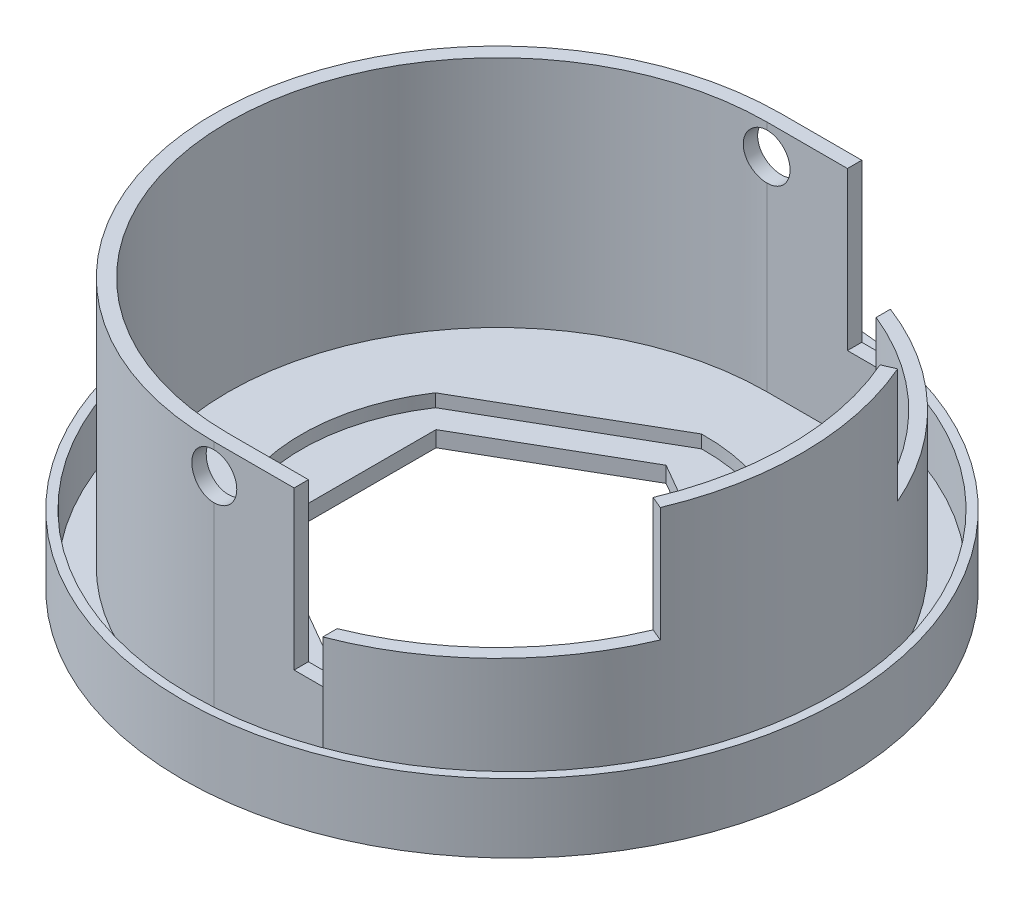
from build123d import *

# Parameters (mm, degrees)
SKETCH_2_W           = 50
SKETCH_2_H           = 50
EXTRUDE_2_DEPTH      = 2
SKETCH_6_W           = 68.418235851
SKETCH_6_H           = 62.547603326
CUT_EXTRUDE_4_DEPTH  = 2
CUT_EXTRUDE_5_DEPTH  = 2
CUT_EXTRUDE_6_DEPTH  = 0.9
EXTRUDE_3_DEPTH      = 2
EXTRUDE_4_DEPTH      = 16.3
EXTRUDE_4_DEPTH_BACK = 2
SKETCH_12_W          = 2
SKETCH_12_H          = 39.6
CUT_EXTRUDE_8_DEPTH  = 11
SKETCH_13_R          = 23
SKETCH_13_R_2        = 19.234840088
EXTRUDE_5_DEPTH      = 0.8
SKETCH_14_R          = 23
SKETCH_14_R_2        = 22.4
EXTRUDE_6_DEPTH      = 4
SKETCH_15_R          = 1.6
CUT_EXTRUDE_9_DEPTH  = 1.2
CUT_EXTRUDE_START    = -1.2
SKETCH_16_R          = 1.6
CUT_EXTRUDE_10_DEPTH = 1.2
SKETCH_17_R          = 15
SKETCH_17_R_2        = 14
CUT_EXTRUDE_11_DEPTH = 0.6
SKETCH_18_R          = 1.5
CUT_EXTRUDE_12_DEPTH = 0.7
CUT_EXTRUDE_13_DEPTH = 8
SKETCH_20_R          = 17
SKETCH_20_R_2        = 16.5
EXTRUDE_7_DEPTH      = 3


with BuildPart() as part:
    # Sketch 2 → Extrude 2 (new body)
    with BuildSketch(Plane(origin=(0, 0, 0), x_dir=(1, 0, 0), z_dir=(0, 1, 0))):
        Rectangle(SKETCH_2_W, SKETCH_2_H)
    extrude(amount=EXTRUDE_2_DEPTH)

    # Sketch 6 → Cut-Extrude 4 (cut)
    with BuildSketch(Plane(origin=(19.566219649, 2, 0), x_dir=(1, 0, 0), z_dir=(0, 1, 0))):
        with Locations((-16.859445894, -2.398316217)):
            Rectangle(SKETCH_6_W, SKETCH_6_H)
        with BuildLine():
            Line((-19.566219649, -18.5), (-11.966877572, -18.5))
            ThreePointArc((-11.966877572, -18.5), (0.433780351, 0), (-11.966877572, 18.5))
            Line((-11.966877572, 18.5), (-19.566219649, 18.5))
            ThreePointArc((-19.566219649, 18.5), (-38.066219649, 0), (-19.566219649, -18.5))
        make_face(mode=Mode.SUBTRACT)
    extrude(amount=-CUT_EXTRUDE_4_DEPTH, mode=Mode.SUBTRACT)

    # Sketch 7 → Cut-Extrude 5 (cut)
    with BuildSketch(Plane(origin=(19.566219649, 0, 0), x_dir=(-1, 0, 0), z_dir=(0, -1, 0))):
        Polygon((19.566219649, 11.749077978), (9.391219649, 5.874538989), (9.391219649, -5.874538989), (19.566219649, -11.749077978), (29.741219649, -5.874538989), (29.741219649, 5.874538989), align=None)
    extrude(amount=-CUT_EXTRUDE_5_DEPTH, mode=Mode.SUBTRACT)

    # Sketch 8 → Cut-Extrude 6 (cut)
    with BuildSketch(Plane(origin=(0, 2, 0), x_dir=(1, 0, 0), z_dir=(0, 1, 0))):
        with BuildLine():
            Line((12.375, 6.8), (12.375, -6.8))
            ThreePointArc((12.375, -6.8), (7.323143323, -12.092998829), (0.251874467, -13.972958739))
            Line((0.251874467, -13.972958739), (-11.526071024, -7.172958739))
            ThreePointArc((-11.526071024, -7.172958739), (-13.684084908, 0), (-11.526071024, 7.172958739))
            Line((-11.526071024, 7.172958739), (0.251874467, 13.972958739))
            ThreePointArc((0.251874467, 13.972958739), (7.323143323, 12.092998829), (12.375, 6.8))
        make_face()
    extrude(amount=-CUT_EXTRUDE_6_DEPTH, mode=Mode.SUBTRACT)

    # Sketch 9 → Extrude 3 (add)
    with BuildSketch(Plane(origin=(0, 2, 0), x_dir=(1, 0, 0), z_dir=(0, 1, 0))):
        with BuildLine():
            Line((7.599342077, 18.8), (0, 18.8))
            ThreePointArc((0, 18.8), (-18.8, 0), (0, -18.8))
            Line((0, -18.8), (7.599342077, -18.8))
            ThreePointArc((7.599342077, -18.8), (20.277820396, 0), (7.599342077, 18.8))
        make_face()
        with BuildLine():
            Line((0, 18.5), (7.599342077, 18.5))
            ThreePointArc((7.599342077, 18.5), (20, 0), (7.599342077, -18.5))
            Line((7.599342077, -18.5), (0, -18.5))
            ThreePointArc((0, -18.5), (-18.5, 0), (0, 18.5))
        make_face(mode=Mode.SUBTRACT)
    extrude(amount=-EXTRUDE_3_DEPTH)

    # Sketch 11 → Extrude 4 (add, two sides: drawn at the far end of the back side and taken through both)
    with BuildSketch(Plane(origin=(0, 2, 0), x_dir=(1, 0, 0), z_dir=(0, 1, 0)).offset(-EXTRUDE_4_DEPTH_BACK)):
        with BuildLine():
            Line((7.599342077, 19.8), (0, 19.8))
            ThreePointArc((0, 19.8), (-19.8, 0), (0, -19.8))
            Line((0, -19.8), (7.599342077, -19.8))
            ThreePointArc((7.599342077, -19.8), (21.208253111, 0), (7.599342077, 19.8))
        make_face()
        with BuildLine():
            Line((0, 18.8), (7.599342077, 18.8))
            ThreePointArc((7.599342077, 18.8), (20.277820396, 0), (7.599342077, -18.8))
            Line((7.599342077, -18.8), (0, -18.8))
            ThreePointArc((0, -18.8), (-18.8, 0), (0, 18.8))
        make_face(mode=Mode.SUBTRACT)
    extrude(amount=EXTRUDE_4_DEPTH + EXTRUDE_4_DEPTH_BACK)

    # Sketch 12 → Cut-Extrude 8 (cut)
    with BuildSketch(Plane(origin=(0, 18.3, 0), x_dir=(1, 0, 0), z_dir=(0, 1, 0))):
        with Locations((6.599342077, 0)):
            Rectangle(SKETCH_12_W, SKETCH_12_H)
    extrude(amount=-CUT_EXTRUDE_8_DEPTH, mode=Mode.SUBTRACT)

    # Sketch 13 → Extrude 5 (add)
    with BuildSketch(Plane(origin=(0, 0, 0), x_dir=(-1, 0, 0), z_dir=(0, -1, 0))):
        with Locations(Location((-1, 0, 0), (0, 0, 90))):
            Circle(SKETCH_13_R)
        with Locations((-1, 0)):
            Circle(SKETCH_13_R_2, mode=Mode.SUBTRACT)
    extrude(amount=-EXTRUDE_5_DEPTH)

    # Sketch 14 → Extrude 6 (add)
    with BuildSketch(Plane(origin=(0, 0.8, 0), x_dir=(1, 0, 0), z_dir=(0, 1, 0))):
        with Locations(Location((1, 0, 0), (0, 0, 90))):
            Circle(SKETCH_14_R)
        with Locations(Location((1, 0, 0), (0, 0, 270))):
            Circle(SKETCH_14_R_2, mode=Mode.SUBTRACT)
    extrude(amount=EXTRUDE_6_DEPTH)

    # Sketch 15 → Cut-Extrude 9 (cut)
    with BuildSketch(Plane(origin=(19.566219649, 18.450605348, -19.8), x_dir=(-1, 0, 0), z_dir=(0, 0, -1))):
        with Locations(Location((19.566219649, -2.238105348, 0), (0, 0, 90))):
            Circle(SKETCH_15_R)
    extrude(amount=-CUT_EXTRUDE_9_DEPTH, mode=Mode.SUBTRACT)

    # Sketch 16 → Cut-Extrude 10 (cut)
    with BuildSketch(Plane(origin=(19.566219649, 18.450605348, 19.8), x_dir=(1, 0, 0), z_dir=(0, 0, 1)).offset(CUT_EXTRUDE_START)):
        with Locations(Location((-19.566219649, -2.238105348, 0), (0, 0, 90))):
            Circle(SKETCH_16_R)
    extrude(amount=CUT_EXTRUDE_10_DEPTH, mode=Mode.SUBTRACT)

    # Sketch 17 → Cut-Extrude 11 (cut)
    with BuildSketch(Plane(origin=(0, 0, 0), x_dir=(-1, 0, 0), z_dir=(0, -1, 0))):
        with Locations(Location((0, 0, 0), (0, 0, 90))):
            Circle(SKETCH_17_R)
        with Locations(Location((0, 0, 0), (0, 0, 90))):
            Circle(SKETCH_17_R_2, mode=Mode.SUBTRACT)
    extrude(amount=-CUT_EXTRUDE_11_DEPTH, mode=Mode.SUBTRACT)

    # Sketch 18 → Cut-Extrude 12 (cut)
    with BuildSketch(Plane(origin=(0, 0, 0), x_dir=(-1, 0, 0), z_dir=(0, -1, 0))):
        with Locations(Location((-22, 0, 0), (0, 0, 90))):
            Circle(SKETCH_18_R)
    extrude(amount=-CUT_EXTRUDE_12_DEPTH, mode=Mode.SUBTRACT)

    # Sketch 19 → Cut-Extrude 13 (cut)
    with BuildSketch(Plane(origin=(0, 18.3, 0), x_dir=(1, 0, 0), z_dir=(0, 1, 0))):
        Polygon((7.709756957, 23.363856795), (0, 0), (27.121107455, 11.774942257), align=None)
        Polygon((28.071534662, -11.787732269), (0, 0), (8.071294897, -24.564680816), align=None)
    extrude(amount=-CUT_EXTRUDE_13_DEPTH, mode=Mode.SUBTRACT)

    # Sketch 20 → Extrude 7 (add)
    with BuildSketch(Plane.XZ):
        with Locations(Location((0, 0, 0), (0, 0, 90))):
            Circle(SKETCH_20_R)
        with Locations(Location((0, 0, 0), (0, 0, 270))):
            Circle(SKETCH_20_R_2, mode=Mode.SUBTRACT)
    extrude(amount=EXTRUDE_7_DEPTH)


solid = part.part
